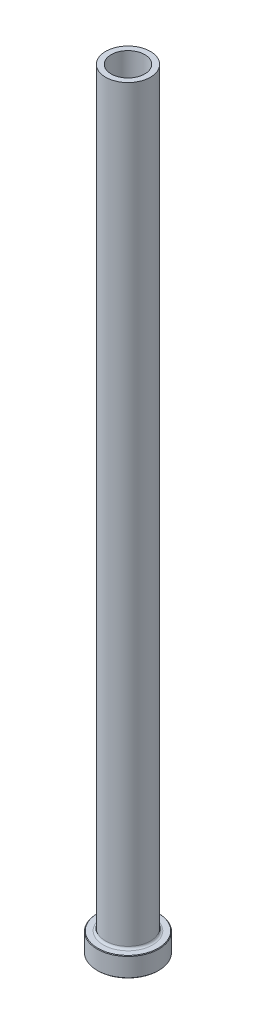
ISO-10303-21;
HEADER;
FILE_DESCRIPTION(('STEP AP214'),'2;1');
FILE_NAME('part.step','',(''),(''),'','','');
FILE_SCHEMA(('AUTOMOTIVE_DESIGN { 1 0 10303 214 1 1 1 1 }'));
ENDSEC;
DATA;
#1=APPLICATION_CONTEXT('core data for automotive mechanical design processes');
#2=APPLICATION_PROTOCOL_DEFINITION('international standard','automotive_design',2000,#1);
#3=PRODUCT_CONTEXT('',#1,'mechanical');
#4=PRODUCT('Part','Part','',(#3));
#5=PRODUCT_RELATED_PRODUCT_CATEGORY('part','',(#4));
#6=PRODUCT_DEFINITION_FORMATION('','',#4);
#7=PRODUCT_DEFINITION_CONTEXT('part definition',#1,'design');
#8=PRODUCT_DEFINITION('design','',#6,#7);
#9=PRODUCT_DEFINITION_SHAPE('','',#8);
#10=(LENGTH_UNIT() NAMED_UNIT(*) SI_UNIT(.MILLI.,.METRE.));
#11=(NAMED_UNIT(*) PLANE_ANGLE_UNIT() SI_UNIT($,.RADIAN.));
#12=(NAMED_UNIT(*) SI_UNIT($,.STERADIAN.) SOLID_ANGLE_UNIT());
#13=UNCERTAINTY_MEASURE_WITH_UNIT(LENGTH_MEASURE(1.E-05),#10,'distance_accuracy_value','');
#14=(GEOMETRIC_REPRESENTATION_CONTEXT(3) GLOBAL_UNCERTAINTY_ASSIGNED_CONTEXT((#13)) GLOBAL_UNIT_ASSIGNED_CONTEXT((#10,
#11,#12)) REPRESENTATION_CONTEXT('',''));
#15=CARTESIAN_POINT('',(0.,0.,0.));
#16=DIRECTION('',(0.,0.,1.));
#17=DIRECTION('',(1.,0.,0.));
#18=AXIS2_PLACEMENT_3D('',#15,#16,#17);
#19=CARTESIAN_POINT('',(0.,92.1876809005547,0.));
#20=DIRECTION('',(0.,1.,0.));
#21=DIRECTION('',(0.,0.,1.));
#22=AXIS2_PLACEMENT_3D('',#19,#20,#21);
#23=CYLINDRICAL_SURFACE('',#22,6.00000000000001);
#24=CARTESIAN_POINT('',(0.,275.,0.));
#25=DIRECTION('',(0.,1.,0.));
#26=DIRECTION('',(0.,0.,1.));
#27=AXIS2_PLACEMENT_3D('',#24,#25,#26);
#28=CIRCLE('',#27,6.00000000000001);
#29=CARTESIAN_POINT('',(0.,275.,6.00000000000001));
#30=VERTEX_POINT('',#29);
#31=EDGE_CURVE('E62',#30,#30,#28,.T.);
#32=ORIENTED_EDGE('',*,*,#31,.T.);
#33=EDGE_LOOP('',(#32));
#34=FACE_BOUND('',#33,.T.);
#35=CARTESIAN_POINT('',(0.,220.,0.));
#36=DIRECTION('',(0.,1.,0.));
#37=DIRECTION('',(0.,0.,1.));
#38=AXIS2_PLACEMENT_3D('',#35,#36,#37);
#39=CIRCLE('',#38,6.00000000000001);
#40=CARTESIAN_POINT('',(0.,220.,6.00000000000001));
#41=VERTEX_POINT('',#40);
#42=EDGE_CURVE('E71',#41,#41,#39,.T.);
#43=ORIENTED_EDGE('',*,*,#42,.F.);
#44=EDGE_LOOP('',(#43));
#45=FACE_BOUND('',#44,.T.);
#46=ADVANCED_FACE('F30',(#34,#45),#23,.F.);
#47=CARTESIAN_POINT('',(-6.00000000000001,275.,0.));
#48=DIRECTION('',(0.,1.,0.));
#49=DIRECTION('',(0.,0.,1.));
#50=AXIS2_PLACEMENT_3D('',#47,#48,#49);
#51=PLANE('',#50);
#52=CARTESIAN_POINT('',(0.,275.,0.));
#53=DIRECTION('',(0.,1.,0.));
#54=DIRECTION('',(0.,0.,1.));
#55=AXIS2_PLACEMENT_3D('',#52,#53,#54);
#56=CIRCLE('',#55,8.00000000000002);
#57=CARTESIAN_POINT('',(0.,275.,8.00000000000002));
#58=VERTEX_POINT('',#57);
#59=EDGE_CURVE('E65',#58,#58,#56,.T.);
#60=ORIENTED_EDGE('',*,*,#59,.T.);
#61=EDGE_LOOP('',(#60));
#62=FACE_BOUND('',#61,.T.);
#63=ORIENTED_EDGE('',*,*,#31,.F.);
#64=EDGE_LOOP('',(#63));
#65=FACE_BOUND('',#64,.T.);
#66=ADVANCED_FACE('F79',(#62,#65),#51,.T.);
#67=CARTESIAN_POINT('',(0.,92.1876809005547,0.));
#68=DIRECTION('',(0.,1.,0.));
#69=DIRECTION('',(0.,0.,1.));
#70=AXIS2_PLACEMENT_3D('',#67,#68,#69);
#71=CYLINDRICAL_SURFACE('',#70,8.00000000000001);
#72=CARTESIAN_POINT('',(0.,7.8,0.));
#73=DIRECTION('',(0.,1.,0.));
#74=DIRECTION('',(0.,0.,1.));
#75=AXIS2_PLACEMENT_3D('',#72,#73,#74);
#76=CIRCLE('',#75,8.00000000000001);
#77=CARTESIAN_POINT('',(0.,7.8,8.00000000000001));
#78=VERTEX_POINT('',#77);
#79=EDGE_CURVE('E59',#78,#78,#76,.T.);
#80=ORIENTED_EDGE('',*,*,#79,.T.);
#81=EDGE_LOOP('',(#80));
#82=FACE_BOUND('',#81,.T.);
#83=ORIENTED_EDGE('',*,*,#59,.F.);
#84=EDGE_LOOP('',(#83));
#85=FACE_BOUND('',#84,.T.);
#86=ADVANCED_FACE('F85',(#82,#85),#71,.T.);
#87=CARTESIAN_POINT('',(-7.99999999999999,7.,0.));
#88=DIRECTION('',(0.,1.,0.));
#89=DIRECTION('',(0.,0.,1.));
#90=AXIS2_PLACEMENT_3D('',#87,#88,#89);
#91=PLANE('',#90);
#92=CARTESIAN_POINT('',(0.,7.,0.));
#93=DIRECTION('',(0.,1.,0.));
#94=DIRECTION('',(0.,0.,1.));
#95=AXIS2_PLACEMENT_3D('',#92,#93,#94);
#96=CIRCLE('',#95,10.8);
#97=CARTESIAN_POINT('',(0.,7.,10.8));
#98=VERTEX_POINT('',#97);
#99=EDGE_CURVE('E53',#98,#98,#96,.T.);
#100=ORIENTED_EDGE('',*,*,#99,.T.);
#101=EDGE_LOOP('',(#100));
#102=FACE_BOUND('',#101,.T.);
#103=CARTESIAN_POINT('',(0.,7.,0.));
#104=DIRECTION('',(0.,1.,0.));
#105=DIRECTION('',(0.,0.,1.));
#106=AXIS2_PLACEMENT_3D('',#103,#104,#105);
#107=CIRCLE('',#106,8.80000000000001);
#108=CARTESIAN_POINT('',(0.,7.,8.80000000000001));
#109=VERTEX_POINT('',#108);
#110=EDGE_CURVE('E56',#109,#109,#107,.F.);
#111=ORIENTED_EDGE('',*,*,#110,.T.);
#112=EDGE_LOOP('',(#111));
#113=FACE_BOUND('',#112,.T.);
#114=ADVANCED_FACE('F111',(#102,#113),#91,.T.);
#115=CARTESIAN_POINT('',(0.,92.1876809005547,0.));
#116=DIRECTION('',(0.,1.,0.));
#117=DIRECTION('',(0.,0.,1.));
#118=AXIS2_PLACEMENT_3D('',#115,#116,#117);
#119=CYLINDRICAL_SURFACE('',#118,11.);
#120=CARTESIAN_POINT('',(0.,6.79999999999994,0.));
#121=DIRECTION('',(0.,1.,0.));
#122=DIRECTION('',(0.,0.,1.));
#123=AXIS2_PLACEMENT_3D('',#120,#121,#122);
#124=CIRCLE('',#123,11.);
#125=CARTESIAN_POINT('',(0.,6.79999999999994,11.));
#126=VERTEX_POINT('',#125);
#127=EDGE_CURVE('E45',#126,#126,#124,.F.);
#128=ORIENTED_EDGE('',*,*,#127,.T.);
#129=EDGE_LOOP('',(#128));
#130=FACE_BOUND('',#129,.T.);
#131=CARTESIAN_POINT('',(0.,0.199999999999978,0.));
#132=DIRECTION('',(0.,-1.,0.));
#133=DIRECTION('',(0.,0.,-1.));
#134=AXIS2_PLACEMENT_3D('',#131,#132,#133);
#135=CIRCLE('',#134,11.);
#136=CARTESIAN_POINT('',(0.,0.199999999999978,11.));
#137=VERTEX_POINT('',#136);
#138=EDGE_CURVE('E50',#137,#137,#135,.F.);
#139=ORIENTED_EDGE('',*,*,#138,.T.);
#140=EDGE_LOOP('',(#139));
#141=FACE_BOUND('',#140,.T.);
#142=ADVANCED_FACE('F108',(#130,#141),#119,.T.);
#143=CARTESIAN_POINT('',(-11.,0.,0.));
#144=DIRECTION('',(0.,-1.,0.));
#145=DIRECTION('',(0.,0.,-1.));
#146=AXIS2_PLACEMENT_3D('',#143,#144,#145);
#147=PLANE('',#146);
#148=CARTESIAN_POINT('',(0.,0.,0.));
#149=DIRECTION('',(0.,-1.,0.));
#150=DIRECTION('',(0.,0.,-1.));
#151=AXIS2_PLACEMENT_3D('',#148,#149,#150);
#152=CIRCLE('',#151,6.74999999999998);
#153=CARTESIAN_POINT('',(0.,0.,-6.74999999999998));
#154=VERTEX_POINT('',#153);
#155=EDGE_CURVE('E37',#154,#154,#152,.F.);
#156=ORIENTED_EDGE('',*,*,#155,.T.);
#157=EDGE_LOOP('',(#156));
#158=FACE_BOUND('',#157,.T.);
#159=CARTESIAN_POINT('',(0.,0.,0.));
#160=DIRECTION('',(0.,-1.,0.));
#161=DIRECTION('',(0.,0.,-1.));
#162=AXIS2_PLACEMENT_3D('',#159,#160,#161);
#163=CIRCLE('',#162,10.8);
#164=CARTESIAN_POINT('',(0.,0.,10.8));
#165=VERTEX_POINT('',#164);
#166=EDGE_CURVE('E41',#165,#165,#163,.T.);
#167=ORIENTED_EDGE('',*,*,#166,.T.);
#168=EDGE_LOOP('',(#167));
#169=FACE_BOUND('',#168,.T.);
#170=ADVANCED_FACE('F110',(#158,#169),#147,.T.);
#171=CARTESIAN_POINT('',(0.,92.1876809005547,0.));
#172=DIRECTION('',(0.,1.,0.));
#173=DIRECTION('',(0.,0.,1.));
#174=AXIS2_PLACEMENT_3D('',#171,#172,#173);
#175=CYLINDRICAL_SURFACE('',#174,6.25);
#176=CARTESIAN_POINT('',(0.,0.500000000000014,0.));
#177=DIRECTION('',(0.,-1.,0.));
#178=DIRECTION('',(0.,0.,-1.));
#179=AXIS2_PLACEMENT_3D('',#176,#177,#178);
#180=CIRCLE('',#179,6.25);
#181=CARTESIAN_POINT('',(0.,0.500000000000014,-6.25));
#182=VERTEX_POINT('',#181);
#183=EDGE_CURVE('E10',#182,#182,#180,.T.);
#184=ORIENTED_EDGE('',*,*,#183,.T.);
#185=EDGE_LOOP('',(#184));
#186=FACE_BOUND('',#185,.T.);
#187=CARTESIAN_POINT('',(0.,208.,0.));
#188=DIRECTION('',(0.,1.,0.));
#189=DIRECTION('',(0.,0.,1.));
#190=AXIS2_PLACEMENT_3D('',#187,#188,#189);
#191=CIRCLE('',#190,6.25000000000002);
#192=CARTESIAN_POINT('',(0.,208.,6.25000000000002));
#193=VERTEX_POINT('',#192);
#194=EDGE_CURVE('E68',#193,#193,#191,.T.);
#195=ORIENTED_EDGE('',*,*,#194,.T.);
#196=EDGE_LOOP('',(#195));
#197=FACE_BOUND('',#196,.T.);
#198=ADVANCED_FACE('F118',(#186,#197),#175,.F.);
#199=CARTESIAN_POINT('',(0.,208.,0.));
#200=DIRECTION('',(0.,-1.,0.));
#201=DIRECTION('',(0.,0.,-1.));
#202=AXIS2_PLACEMENT_3D('',#199,#200,#201);
#203=CONICAL_SURFACE('',#202,6.25000000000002,0.0208303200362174);
#204=ORIENTED_EDGE('',*,*,#42,.T.);
#205=EDGE_LOOP('',(#204));
#206=FACE_BOUND('',#205,.T.);
#207=ORIENTED_EDGE('',*,*,#194,.F.);
#208=EDGE_LOOP('',(#207));
#209=FACE_BOUND('',#208,.T.);
#210=ADVANCED_FACE('F75',(#206,#209),#203,.F.);
#211=CARTESIAN_POINT('',(0.,7.8,0.));
#212=DIRECTION('',(0.,1.,0.));
#213=DIRECTION('',(0.,0.,1.));
#214=AXIS2_PLACEMENT_3D('',#211,#212,#213);
#215=TOROIDAL_SURFACE('',#214,8.80000000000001,0.8);
#216=ORIENTED_EDGE('',*,*,#110,.F.);
#217=EDGE_LOOP('',(#216));
#218=FACE_BOUND('',#217,.T.);
#219=ORIENTED_EDGE('',*,*,#79,.F.);
#220=EDGE_LOOP('',(#219));
#221=FACE_BOUND('',#220,.T.);
#222=ADVANCED_FACE('F90',(#218,#221),#215,.F.);
#223=CARTESIAN_POINT('',(0.,7.00000000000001,0.));
#224=DIRECTION('',(0.,-1.,0.));
#225=DIRECTION('',(0.,0.,-1.));
#226=AXIS2_PLACEMENT_3D('',#223,#224,#225);
#227=CONICAL_SURFACE('',#226,10.7999999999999,0.785398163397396);
#228=ORIENTED_EDGE('',*,*,#127,.F.);
#229=EDGE_LOOP('',(#228));
#230=FACE_BOUND('',#229,.T.);
#231=ORIENTED_EDGE('',*,*,#99,.F.);
#232=EDGE_LOOP('',(#231));
#233=FACE_BOUND('',#232,.T.);
#234=ADVANCED_FACE('F93',(#230,#233),#227,.T.);
#235=CARTESIAN_POINT('',(0.,0.199999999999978,0.));
#236=DIRECTION('',(0.,1.,0.));
#237=DIRECTION('',(0.,0.,1.));
#238=AXIS2_PLACEMENT_3D('',#235,#236,#237);
#239=CONICAL_SURFACE('',#238,11.,0.785398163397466);
#240=CARTESIAN_POINT('',(0.,0.,10.8));
#241=CARTESIAN_POINT('',(0.,0.00208333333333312,10.8020833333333));
#242=CARTESIAN_POINT('',(0.,0.00416666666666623,10.8041666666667));
#243=CARTESIAN_POINT('',(0.,0.00833333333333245,10.8083333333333));
#244=CARTESIAN_POINT('',(0.,0.0104166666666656,10.8104166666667));
#245=CARTESIAN_POINT('',(0.,0.0145833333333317,10.8145833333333));
#246=CARTESIAN_POINT('',(0.,0.0166666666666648,10.8166666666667));
#247=CARTESIAN_POINT('',(0.,0.0208333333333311,10.8208333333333));
#248=CARTESIAN_POINT('',(0.,0.0229166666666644,10.8229166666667));
#249=CARTESIAN_POINT('',(0.,0.0270833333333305,10.8270833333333));
#250=CARTESIAN_POINT('',(0.,0.0291666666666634,10.8291666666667));
#251=CARTESIAN_POINT('',(0.,0.0333333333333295,10.8333333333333));
#252=CARTESIAN_POINT('',(0.,0.0354166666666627,10.8354166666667));
#253=CARTESIAN_POINT('',(0.,0.0395833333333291,10.8395833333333));
#254=CARTESIAN_POINT('',(0.,0.0416666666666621,10.8416666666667));
#255=CARTESIAN_POINT('',(0.,0.0458333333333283,10.8458333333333));
#256=CARTESIAN_POINT('',(0.,0.0479166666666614,10.8479166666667));
#257=CARTESIAN_POINT('',(0.,0.0520833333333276,10.8520833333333));
#258=CARTESIAN_POINT('',(0.,0.0541666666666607,10.8541666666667));
#259=CARTESIAN_POINT('',(0.,0.0583333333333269,10.8583333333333));
#260=CARTESIAN_POINT('',(0.,0.06041666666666,10.8604166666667));
#261=CARTESIAN_POINT('',(0.,0.0645833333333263,10.8645833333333));
#262=CARTESIAN_POINT('',(0.,0.0666666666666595,10.8666666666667));
#263=CARTESIAN_POINT('',(0.,0.0708333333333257,10.8708333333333));
#264=CARTESIAN_POINT('',(0.,0.0729166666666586,10.8729166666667));
#265=CARTESIAN_POINT('',(0.,0.0770833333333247,10.8770833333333));
#266=CARTESIAN_POINT('',(0.,0.0791666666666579,10.8791666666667));
#267=CARTESIAN_POINT('',(0.,0.0833333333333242,10.8833333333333));
#268=CARTESIAN_POINT('',(0.,0.0854166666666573,10.8854166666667));
#269=CARTESIAN_POINT('',(0.,0.0895833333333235,10.8895833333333));
#270=CARTESIAN_POINT('',(0.,0.0916666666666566,10.8916666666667));
#271=CARTESIAN_POINT('',(0.,0.0958333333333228,10.8958333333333));
#272=CARTESIAN_POINT('',(0.,0.0979166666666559,10.8979166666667));
#273=CARTESIAN_POINT('',(0.,0.102083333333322,10.9020833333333));
#274=CARTESIAN_POINT('',(0.,0.104166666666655,10.9041666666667));
#275=CARTESIAN_POINT('',(0.,0.108333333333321,10.9083333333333));
#276=CARTESIAN_POINT('',(0.,0.110416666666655,10.9104166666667));
#277=CARTESIAN_POINT('',(0.,0.114583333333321,10.9145833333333));
#278=CARTESIAN_POINT('',(0.,0.116666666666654,10.9166666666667));
#279=CARTESIAN_POINT('',(0.,0.12083333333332,10.9208333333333));
#280=CARTESIAN_POINT('',(0.,0.122916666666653,10.9229166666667));
#281=CARTESIAN_POINT('',(0.,0.127083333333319,10.9270833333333));
#282=CARTESIAN_POINT('',(0.,0.129166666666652,10.9291666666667));
#283=CARTESIAN_POINT('',(0.,0.133333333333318,10.9333333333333));
#284=CARTESIAN_POINT('',(0.,0.135416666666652,10.9354166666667));
#285=CARTESIAN_POINT('',(0.,0.139583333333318,10.9395833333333));
#286=CARTESIAN_POINT('',(0.,0.141666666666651,10.9416666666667));
#287=CARTESIAN_POINT('',(0.,0.145833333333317,10.9458333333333));
#288=CARTESIAN_POINT('',(0.,0.14791666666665,10.9479166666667));
#289=CARTESIAN_POINT('',(0.,0.152083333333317,10.9520833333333));
#290=CARTESIAN_POINT('',(0.,0.15416666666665,10.9541666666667));
#291=CARTESIAN_POINT('',(0.,0.158333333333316,10.9583333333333));
#292=CARTESIAN_POINT('',(0.,0.160416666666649,10.9604166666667));
#293=CARTESIAN_POINT('',(0.,0.164583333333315,10.9645833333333));
#294=CARTESIAN_POINT('',(0.,0.166666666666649,10.9666666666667));
#295=CARTESIAN_POINT('',(0.,0.170833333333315,10.9708333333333));
#296=CARTESIAN_POINT('',(0.,0.172916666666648,10.9729166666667));
#297=CARTESIAN_POINT('',(0.,0.177083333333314,10.9770833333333));
#298=CARTESIAN_POINT('',(0.,0.179166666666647,10.9791666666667));
#299=CARTESIAN_POINT('',(0.,0.183333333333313,10.9833333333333));
#300=CARTESIAN_POINT('',(0.,0.185416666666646,10.9854166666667));
#301=CARTESIAN_POINT('',(0.,0.189583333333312,10.9895833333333));
#302=CARTESIAN_POINT('',(0.,0.191666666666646,10.9916666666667));
#303=CARTESIAN_POINT('',(0.,0.195833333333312,10.9958333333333));
#304=CARTESIAN_POINT('',(0.,0.197916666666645,10.9979166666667));
#305=CARTESIAN_POINT('',(0.,0.199999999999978,11.));
#306=B_SPLINE_CURVE_WITH_KNOTS('',3,(#240,#241,#242,#243,#244,#245,#246,#247,#248,#249,#250,
#251,#252,#253,#254,#255,#256,#257,#258,#259,#260,#261,#262,#263,#264,#265,#266,#267,#268,#269,
#270,#271,#272,#273,#274,#275,#276,#277,#278,#279,#280,#281,#282,#283,#284,#285,#286,#287,#288,
#289,#290,#291,#292,#293,#294,#295,#296,#297,#298,#299,#300,#301,#302,#303,#304,#305),
.UNSPECIFIED.,.F.,.F.,(4,2,2,2,2,2,2,2,2,2,2,2,2,2,2,2,2,2,2,2,2,2,2,2,2,2,2,2,2,2,2,2,4),(0.,
0.00883883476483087,0.0176776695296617,0.0265165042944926,0.0353553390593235,0.0441941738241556,
0.0530330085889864,0.0618718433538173,0.0707106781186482,0.079549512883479,0.0883883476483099,
0.0972271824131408,0.106066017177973,0.114904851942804,0.123743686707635,0.132582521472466,
0.141421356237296,0.150260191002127,0.159099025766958,0.167937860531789,0.17677669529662,
0.185615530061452,0.194454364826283,0.203293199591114,0.212132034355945,0.220970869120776,
0.229809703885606,0.238648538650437,0.247487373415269,0.2563262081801,0.265165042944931,
0.274003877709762,0.282842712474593),.UNSPECIFIED.);
#307=EDGE_CURVE('BSEAM96',#165,#137,#306,.T.);
#308=ORIENTED_EDGE('',*,*,#166,.F.);
#309=ORIENTED_EDGE('',*,*,#138,.F.);
#310=ORIENTED_EDGE('',*,*,#307,.T.);
#311=ORIENTED_EDGE('',*,*,#307,.F.);
#312=EDGE_LOOP('',(#308,#310,#309,#311));
#313=FACE_BOUND('',#312,.T.);
#314=ADVANCED_FACE('F96',(#313),#239,.T.);
#315=CARTESIAN_POINT('',(0.,0.,0.));
#316=DIRECTION('',(0.,-1.,0.));
#317=DIRECTION('',(0.,0.,-1.));
#318=AXIS2_PLACEMENT_3D('',#315,#316,#317);
#319=CONICAL_SURFACE('',#318,6.74999999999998,0.785398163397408);
#320=ORIENTED_EDGE('',*,*,#183,.F.);
#321=EDGE_LOOP('',(#320));
#322=FACE_BOUND('',#321,.T.);
#323=ORIENTED_EDGE('',*,*,#155,.F.);
#324=EDGE_LOOP('',(#323));
#325=FACE_BOUND('',#324,.T.);
#326=ADVANCED_FACE('F32',(#322,#325),#319,.F.);
#327=CLOSED_SHELL('',(#46,#66,#86,#114,#142,#170,#198,#210,#222,#234,#314,#326));
#328=MANIFOLD_SOLID_BREP('B2',#327);
#329=ADVANCED_BREP_SHAPE_REPRESENTATION('',(#18,#328),#14);
#330=SHAPE_DEFINITION_REPRESENTATION(#9,#329);
ENDSEC;
END-ISO-10303-21;
